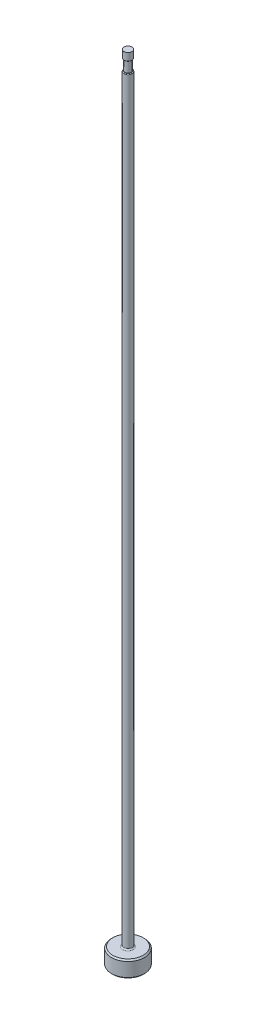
ISO-10303-21;
HEADER;
FILE_DESCRIPTION(('STEP AP214'),'2;1');
FILE_NAME('part.step','',(''),(''),'','','');
FILE_SCHEMA(('AUTOMOTIVE_DESIGN { 1 0 10303 214 1 1 1 1 }'));
ENDSEC;
DATA;
#1=APPLICATION_CONTEXT('core data for automotive mechanical design processes');
#2=APPLICATION_PROTOCOL_DEFINITION('international standard','automotive_design',2000,#1);
#3=PRODUCT_CONTEXT('',#1,'mechanical');
#4=PRODUCT('Part','Part','',(#3));
#5=PRODUCT_RELATED_PRODUCT_CATEGORY('part','',(#4));
#6=PRODUCT_DEFINITION_FORMATION('','',#4);
#7=PRODUCT_DEFINITION_CONTEXT('part definition',#1,'design');
#8=PRODUCT_DEFINITION('design','',#6,#7);
#9=PRODUCT_DEFINITION_SHAPE('','',#8);
#10=(LENGTH_UNIT() NAMED_UNIT(*) SI_UNIT(.MILLI.,.METRE.));
#11=(NAMED_UNIT(*) PLANE_ANGLE_UNIT() SI_UNIT($,.RADIAN.));
#12=(NAMED_UNIT(*) SI_UNIT($,.STERADIAN.) SOLID_ANGLE_UNIT());
#13=UNCERTAINTY_MEASURE_WITH_UNIT(LENGTH_MEASURE(1.E-05),#10,'distance_accuracy_value','');
#14=(GEOMETRIC_REPRESENTATION_CONTEXT(3) GLOBAL_UNCERTAINTY_ASSIGNED_CONTEXT((#13)) GLOBAL_UNIT_ASSIGNED_CONTEXT((#10,
#11,#12)) REPRESENTATION_CONTEXT('',''));
#15=CARTESIAN_POINT('',(0.,0.,0.));
#16=DIRECTION('',(0.,0.,1.));
#17=DIRECTION('',(1.,0.,0.));
#18=AXIS2_PLACEMENT_3D('',#15,#16,#17);
#19=CARTESIAN_POINT('',(-0.793749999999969,150.876,0.));
#20=DIRECTION('',(0.,1.,0.));
#21=DIRECTION('',(0.,0.,1.));
#22=AXIS2_PLACEMENT_3D('',#19,#20,#21);
#23=PLANE('',#22);
#24=CARTESIAN_POINT('',(0.,150.876,0.));
#25=DIRECTION('',(0.,1.,0.));
#26=DIRECTION('',(0.,0.,1.));
#27=AXIS2_PLACEMENT_3D('',#24,#25,#26);
#28=CIRCLE('',#27,0.641349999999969);
#29=CARTESIAN_POINT('',(0.,150.876,0.641349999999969));
#30=VERTEX_POINT('',#29);
#31=EDGE_CURVE('E11',#30,#30,#28,.F.);
#32=ORIENTED_EDGE('',*,*,#31,.T.);
#33=EDGE_LOOP('',(#32));
#34=FACE_BOUND('',#33,.T.);
#35=CARTESIAN_POINT('',(0.,150.876,0.));
#36=DIRECTION('',(0.,1.,0.));
#37=DIRECTION('',(0.,0.,1.));
#38=AXIS2_PLACEMENT_3D('',#35,#36,#37);
#39=CIRCLE('',#38,0.590549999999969);
#40=CARTESIAN_POINT('',(0.,150.876,0.590549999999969));
#41=VERTEX_POINT('',#40);
#42=EDGE_CURVE('E81',#41,#41,#39,.T.);
#43=ORIENTED_EDGE('',*,*,#42,.T.);
#44=EDGE_LOOP('',(#43));
#45=FACE_BOUND('',#44,.T.);
#46=ADVANCED_FACE('F39',(#34,#45),#23,.F.);
#47=CARTESIAN_POINT('',(0.,259.958771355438,0.));
#48=DIRECTION('',(0.,1.,0.));
#49=DIRECTION('',(0.,0.,1.));
#50=AXIS2_PLACEMENT_3D('',#47,#48,#49);
#51=CYLINDRICAL_SURFACE('',#50,0.793749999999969);
#52=DIRECTION('',(0.,1.,0.));
#53=VECTOR('',#52,1.);
#54=CARTESIAN_POINT('',(-0.590549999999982,259.958771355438,-0.530367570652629));
#55=LINE('',#54,#53);
#56=CARTESIAN_POINT('',(-0.590549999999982,148.717,-0.530367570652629));
#57=VERTEX_POINT('',#56);
#58=CARTESIAN_POINT('',(-0.590549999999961,86.36,-0.530367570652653));
#59=VERTEX_POINT('',#58);
#60=EDGE_CURVE('E76',#57,#59,#55,.F.);
#61=ORIENTED_EDGE('',*,*,#60,.F.);
#62=CARTESIAN_POINT('',(0.,148.717,0.));
#63=DIRECTION('',(0.,-1.,0.));
#64=DIRECTION('',(0.,0.,-1.));
#65=AXIS2_PLACEMENT_3D('',#62,#63,#64);
#66=CIRCLE('',#65,0.793749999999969);
#67=CARTESIAN_POINT('',(-0.590549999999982,148.717,0.530367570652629));
#68=VERTEX_POINT('',#67);
#69=EDGE_CURVE('E54',#57,#68,#66,.T.);
#70=ORIENTED_EDGE('',*,*,#69,.T.);
#71=DIRECTION('',(0.,1.,0.));
#72=VECTOR('',#71,1.);
#73=CARTESIAN_POINT('',(-0.590549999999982,259.958771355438,0.530367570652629));
#74=LINE('',#73,#72);
#75=CARTESIAN_POINT('',(-0.590549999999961,86.36,0.530367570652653));
#76=VERTEX_POINT('',#75);
#77=EDGE_CURVE('E87',#76,#68,#74,.T.);
#78=ORIENTED_EDGE('',*,*,#77,.F.);
#79=CARTESIAN_POINT('',(-0.590549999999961,86.36,-0.530367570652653));
#80=CARTESIAN_POINT('',(-0.59053917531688,86.3041966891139,-0.530314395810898));
#81=CARTESIAN_POINT('',(-0.592020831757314,86.2483728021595,-0.528725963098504));
#82=CARTESIAN_POINT('',(-0.597911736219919,86.1368205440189,-0.522091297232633));
#83=CARTESIAN_POINT('',(-0.60233497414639,86.0810939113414,-0.517028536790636));
#84=CARTESIAN_POINT('',(-0.614284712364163,85.9682022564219,-0.502771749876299));
#85=CARTESIAN_POINT('',(-0.62192823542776,85.9110688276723,-0.493420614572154));
#86=CARTESIAN_POINT('',(-0.640090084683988,85.7984288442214,-0.469629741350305));
#87=CARTESIAN_POINT('',(-0.650601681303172,85.7429188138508,-0.455201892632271));
#88=CARTESIAN_POINT('',(-0.672694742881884,85.6407751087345,-0.421752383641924));
#89=CARTESIAN_POINT('',(-0.684015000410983,85.5938538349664,-0.403447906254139));
#90=CARTESIAN_POINT('',(-0.70779345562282,85.503925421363,-0.360113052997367));
#91=CARTESIAN_POINT('',(-0.720238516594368,85.4608824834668,-0.335155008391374));
#92=CARTESIAN_POINT('',(-0.738199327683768,85.4028429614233,-0.292081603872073));
#93=CARTESIAN_POINT('',(-0.74383162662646,85.3852421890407,-0.277537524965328));
#94=CARTESIAN_POINT('',(-0.754779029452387,85.3519385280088,-0.246220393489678));
#95=CARTESIAN_POINT('',(-0.760093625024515,85.3362386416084,-0.229443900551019));
#96=CARTESIAN_POINT('',(-0.770096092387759,85.3073279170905,-0.193256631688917));
#97=CARTESIAN_POINT('',(-0.774774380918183,85.2941541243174,-0.173812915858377));
#98=CARTESIAN_POINT('',(-0.782879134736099,85.271678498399,-0.132572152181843));
#99=CARTESIAN_POINT('',(-0.786309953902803,85.2623631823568,-0.110783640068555));
#100=CARTESIAN_POINT('',(-0.790553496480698,85.2509260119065,-0.0728220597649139));
#101=CARTESIAN_POINT('',(-0.79185392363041,85.2474525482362,-0.0571082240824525));
#102=CARTESIAN_POINT('',(-0.793506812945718,85.2430442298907,-0.0252785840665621));
#103=CARTESIAN_POINT('',(-0.79385989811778,85.2421077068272,-0.00916305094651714));
#104=CARTESIAN_POINT('',(-0.793579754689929,85.2428527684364,0.0230049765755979));
#105=CARTESIAN_POINT('',(-0.792946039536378,85.2445356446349,0.0390574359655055));
#106=CARTESIAN_POINT('',(-0.790759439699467,85.250380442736,0.0706385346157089));
#107=CARTESIAN_POINT('',(-0.789205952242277,85.2545439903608,0.0861668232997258));
#108=CARTESIAN_POINT('',(-0.784847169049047,85.2663438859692,0.120053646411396));
#109=CARTESIAN_POINT('',(-0.781828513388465,85.2745809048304,0.138174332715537));
#110=CARTESIAN_POINT('',(-0.774926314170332,85.2937453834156,0.172744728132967));
#111=CARTESIAN_POINT('',(-0.771041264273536,85.3046775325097,0.189191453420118));
#112=CARTESIAN_POINT('',(-0.760742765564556,85.3342791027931,0.227766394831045));
#113=CARTESIAN_POINT('',(-0.754005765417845,85.3541551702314,0.248875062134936));
#114=CARTESIAN_POINT('',(-0.740079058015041,85.39684818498,0.287657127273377));
#115=CARTESIAN_POINT('',(-0.732888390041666,85.4196714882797,0.305322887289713));
#116=CARTESIAN_POINT('',(-0.713188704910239,85.4850259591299,0.349810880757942));
#117=CARTESIAN_POINT('',(-0.700707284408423,85.5295752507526,0.373653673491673));
#118=CARTESIAN_POINT('',(-0.677153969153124,85.6219372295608,0.414797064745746));
#119=CARTESIAN_POINT('',(-0.666086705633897,85.6697598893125,0.432076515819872));
#120=CARTESIAN_POINT('',(-0.646811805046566,85.7631939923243,0.460367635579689));
#121=CARTESIAN_POINT('',(-0.638441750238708,85.8086519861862,0.471784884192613));
#122=CARTESIAN_POINT('',(-0.623612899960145,85.9006203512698,0.491217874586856));
#123=CARTESIAN_POINT('',(-0.617155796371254,85.9471316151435,0.499230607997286));
#124=CARTESIAN_POINT('',(-0.606291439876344,86.0407368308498,0.512368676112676));
#125=CARTESIAN_POINT('',(-0.601882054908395,86.087830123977,0.517497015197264));
#126=CARTESIAN_POINT('',(-0.595168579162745,86.1823714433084,0.525204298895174));
#127=CARTESIAN_POINT('',(-0.592864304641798,86.229819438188,0.527783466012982));
#128=CARTESIAN_POINT('',(-0.591267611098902,86.2911029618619,0.529567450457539));
#129=CARTESIAN_POINT('',(-0.590998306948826,86.3048916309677,0.529867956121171));
#130=CARTESIAN_POINT('',(-0.590639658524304,86.332453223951,0.530267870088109));
#131=CARTESIAN_POINT('',(-0.59055004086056,86.3462261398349,0.530367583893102));
#132=CARTESIAN_POINT('',(-0.59054999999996,86.3599999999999,0.530367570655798));
#133=B_SPLINE_CURVE_WITH_KNOTS('',3,(#79,#80,#81,#82,#83,#84,#85,#86,#87,#88,#89,#90,#91,#92,
#93,#94,#95,#96,#97,#98,#99,#100,#101,#102,#103,#104,#105,#106,#107,#108,#109,#110,#111,#112,
#113,#114,#115,#116,#117,#118,#119,#120,#121,#122,#123,#124,#125,#126,#127,#128,#129,#130,#131,
#132),.UNSPECIFIED.,.F.,.F.,(4,2,2,2,2,2,2,2,2,2,2,2,2,2,2,2,2,2,2,2,2,2,2,2,2,2,4),(0.,
0.167401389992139,0.335604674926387,0.510534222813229,0.685056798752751,0.839551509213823,
0.992430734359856,1.06284216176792,1.13336338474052,1.20485071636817,1.27608609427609,
1.32431373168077,1.37250964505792,1.42072932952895,1.46898064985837,1.52904518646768,
1.58921497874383,1.67801053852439,1.76700089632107,1.92226871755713,2.07803266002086,
2.22066560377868,2.36342432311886,2.50603406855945,2.64863136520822,2.69001340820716,
2.73133244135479),.UNSPECIFIED.);
#134=EDGE_CURVE('E84',#59,#76,#133,.T.);
#135=ORIENTED_EDGE('',*,*,#134,.F.);
#136=EDGE_LOOP('',(#61,#70,#78,#135));
#137=FACE_BOUND('',#136,.T.);
#138=CARTESIAN_POINT('',(0.,3.42900000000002,0.));
#139=DIRECTION('',(0.,1.,0.));
#140=DIRECTION('',(0.,0.,1.));
#141=AXIS2_PLACEMENT_3D('',#138,#139,#140);
#142=CIRCLE('',#141,0.793749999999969);
#143=CARTESIAN_POINT('',(0.,3.42900000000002,0.793749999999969));
#144=VERTEX_POINT('',#143);
#145=EDGE_CURVE('E119',#144,#144,#142,.T.);
#146=ORIENTED_EDGE('',*,*,#145,.T.);
#147=EDGE_LOOP('',(#146));
#148=FACE_BOUND('',#147,.T.);
#149=ADVANCED_FACE('F85',(#137,#148),#51,.T.);
#150=CARTESIAN_POINT('',(0.,0.,0.));
#151=DIRECTION('',(0.,-1.,0.));
#152=DIRECTION('',(0.,0.,-1.));
#153=AXIS2_PLACEMENT_3D('',#150,#151,#152);
#154=PLANE('',#153);
#155=CARTESIAN_POINT('',(0.,0.,0.));
#156=DIRECTION('',(0.,-1.,0.));
#157=DIRECTION('',(0.,0.,-1.));
#158=AXIS2_PLACEMENT_3D('',#155,#156,#157);
#159=CIRCLE('',#158,2.92099999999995);
#160=CARTESIAN_POINT('',(0.,0.,-2.92099999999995));
#161=VERTEX_POINT('',#160);
#162=EDGE_CURVE('E116',#161,#161,#159,.T.);
#163=ORIENTED_EDGE('',*,*,#162,.T.);
#164=EDGE_LOOP('',(#163));
#165=FACE_BOUND('',#164,.T.);
#166=ADVANCED_FACE('F195',(#165),#154,.T.);
#167=CARTESIAN_POINT('',(0.,259.958771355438,0.));
#168=DIRECTION('',(0.,1.,0.));
#169=DIRECTION('',(0.,0.,1.));
#170=AXIS2_PLACEMENT_3D('',#167,#168,#169);
#171=CYLINDRICAL_SURFACE('',#170,3.17499999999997);
#172=CARTESIAN_POINT('',(0.,2.92100000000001,0.));
#173=DIRECTION('',(0.,1.,0.));
#174=DIRECTION('',(0.,0.,1.));
#175=AXIS2_PLACEMENT_3D('',#172,#173,#174);
#176=CIRCLE('',#175,3.17499999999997);
#177=CARTESIAN_POINT('',(0.,2.92100000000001,3.17499999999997));
#178=VERTEX_POINT('',#177);
#179=EDGE_CURVE('E113',#178,#178,#176,.F.);
#180=ORIENTED_EDGE('',*,*,#179,.T.);
#181=EDGE_LOOP('',(#180));
#182=FACE_BOUND('',#181,.T.);
#183=CARTESIAN_POINT('',(0.,0.254000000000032,0.));
#184=DIRECTION('',(0.,-1.,0.));
#185=DIRECTION('',(0.,0.,-1.));
#186=AXIS2_PLACEMENT_3D('',#183,#184,#185);
#187=CIRCLE('',#186,3.17499999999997);
#188=CARTESIAN_POINT('',(0.,0.254000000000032,-3.17499999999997));
#189=VERTEX_POINT('',#188);
#190=EDGE_CURVE('E110',#189,#189,#187,.F.);
#191=ORIENTED_EDGE('',*,*,#190,.T.);
#192=EDGE_LOOP('',(#191));
#193=FACE_BOUND('',#192,.T.);
#194=ADVANCED_FACE('F198',(#182,#193),#171,.T.);
#195=CARTESIAN_POINT('',(-3.17499999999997,3.175,0.));
#196=DIRECTION('',(0.,1.,0.));
#197=DIRECTION('',(0.,0.,1.));
#198=AXIS2_PLACEMENT_3D('',#195,#196,#197);
#199=PLANE('',#198);
#200=CARTESIAN_POINT('',(0.,3.175,0.));
#201=DIRECTION('',(0.,1.,0.));
#202=DIRECTION('',(0.,0.,1.));
#203=AXIS2_PLACEMENT_3D('',#200,#201,#202);
#204=CIRCLE('',#203,1.04774999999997);
#205=CARTESIAN_POINT('',(0.,3.175,1.04774999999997));
#206=VERTEX_POINT('',#205);
#207=EDGE_CURVE('E90',#206,#206,#204,.F.);
#208=ORIENTED_EDGE('',*,*,#207,.T.);
#209=EDGE_LOOP('',(#208));
#210=FACE_BOUND('',#209,.T.);
#211=CARTESIAN_POINT('',(0.,3.175,0.));
#212=DIRECTION('',(0.,1.,0.));
#213=DIRECTION('',(0.,0.,1.));
#214=AXIS2_PLACEMENT_3D('',#211,#212,#213);
#215=CIRCLE('',#214,2.92099999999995);
#216=CARTESIAN_POINT('',(0.,3.175,2.92099999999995));
#217=VERTEX_POINT('',#216);
#218=EDGE_CURVE('E107',#217,#217,#215,.T.);
#219=ORIENTED_EDGE('',*,*,#218,.T.);
#220=EDGE_LOOP('',(#219));
#221=FACE_BOUND('',#220,.T.);
#222=ADVANCED_FACE('F193',(#210,#221),#199,.T.);
#223=CARTESIAN_POINT('',(0.,3.17499999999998,0.));
#224=DIRECTION('',(0.,-1.,0.));
#225=DIRECTION('',(0.,0.,-1.));
#226=AXIS2_PLACEMENT_3D('',#223,#224,#225);
#227=CONICAL_SURFACE('',#226,2.92099999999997,0.7853981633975);
#228=ORIENTED_EDGE('',*,*,#179,.F.);
#229=EDGE_LOOP('',(#228));
#230=FACE_BOUND('',#229,.T.);
#231=ORIENTED_EDGE('',*,*,#218,.F.);
#232=EDGE_LOOP('',(#231));
#233=FACE_BOUND('',#232,.T.);
#234=ADVANCED_FACE('F189',(#230,#233),#227,.T.);
#235=CARTESIAN_POINT('',(0.,0.254000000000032,0.));
#236=DIRECTION('',(0.,1.,0.));
#237=DIRECTION('',(0.,0.,1.));
#238=AXIS2_PLACEMENT_3D('',#235,#236,#237);
#239=CONICAL_SURFACE('',#238,3.17499999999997,0.785398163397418);
#240=ORIENTED_EDGE('',*,*,#162,.F.);
#241=EDGE_LOOP('',(#240));
#242=FACE_BOUND('',#241,.T.);
#243=ORIENTED_EDGE('',*,*,#190,.F.);
#244=EDGE_LOOP('',(#243));
#245=FACE_BOUND('',#244,.T.);
#246=ADVANCED_FACE('F185',(#242,#245),#239,.T.);
#247=CARTESIAN_POINT('',(0.,3.42900000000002,0.));
#248=DIRECTION('',(0.,1.,0.));
#249=DIRECTION('',(0.,0.,1.));
#250=AXIS2_PLACEMENT_3D('',#247,#248,#249);
#251=TOROIDAL_SURFACE('',#250,1.04774999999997,0.254);
#252=ORIENTED_EDGE('',*,*,#207,.F.);
#253=EDGE_LOOP('',(#252));
#254=FACE_BOUND('',#253,.T.);
#255=ORIENTED_EDGE('',*,*,#145,.F.);
#256=EDGE_LOOP('',(#255));
#257=FACE_BOUND('',#256,.T.);
#258=ADVANCED_FACE('F150',(#254,#257),#251,.F.);
#259=CARTESIAN_POINT('',(-0.793749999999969,148.844,0.));
#260=DIRECTION('',(0.,-1.,0.));
#261=DIRECTION('',(0.,0.,-1.));
#262=AXIS2_PLACEMENT_3D('',#259,#260,#261);
#263=PLANE('',#262);
#264=DIRECTION('',(0.,0.,1.));
#265=VECTOR('',#264,1.);
#266=CARTESIAN_POINT('',(-0.590549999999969,148.844,0.));
#267=LINE('',#266,#265);
#268=CARTESIAN_POINT('',(-0.590549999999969,148.844,0.));
#269=VERTEX_POINT('',#268);
#270=CARTESIAN_POINT('',(-0.590549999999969,148.844,0.309525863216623));
#271=VERTEX_POINT('',#270);
#272=EDGE_CURVE('E93',#269,#271,#267,.T.);
#273=ORIENTED_EDGE('',*,*,#272,.T.);
#274=CARTESIAN_POINT('',(0.,148.844,0.));
#275=DIRECTION('',(0.,-1.,0.));
#276=DIRECTION('',(0.,0.,-1.));
#277=AXIS2_PLACEMENT_3D('',#274,#275,#276);
#278=CIRCLE('',#277,0.666749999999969);
#279=CARTESIAN_POINT('',(-0.590549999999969,148.844,-0.309525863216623));
#280=VERTEX_POINT('',#279);
#281=EDGE_CURVE('E89',#271,#280,#278,.F.);
#282=ORIENTED_EDGE('',*,*,#281,.T.);
#283=EDGE_CURVE('E82',#280,#269,#267,.T.);
#284=ORIENTED_EDGE('',*,*,#283,.T.);
#285=CARTESIAN_POINT('',(0.,148.844,0.));
#286=DIRECTION('',(0.,1.,0.));
#287=DIRECTION('',(0.,0.,1.));
#288=AXIS2_PLACEMENT_3D('',#285,#286,#287);
#289=CIRCLE('',#288,0.590549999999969);
#290=EDGE_CURVE('E104',#269,#269,#289,.T.);
#291=ORIENTED_EDGE('',*,*,#290,.F.);
#292=EDGE_LOOP('',(#273,#282,#284,#291));
#293=FACE_BOUND('',#292,.T.);
#294=ADVANCED_FACE('F147',(#293),#263,.F.);
#295=CARTESIAN_POINT('',(0.,153.448281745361,0.));
#296=DIRECTION('',(0.,1.,0.));
#297=DIRECTION('',(0.,0.,1.));
#298=AXIS2_PLACEMENT_3D('',#295,#296,#297);
#299=CYLINDRICAL_SURFACE('',#298,0.590549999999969);
#300=ORIENTED_EDGE('',*,*,#42,.F.);
#301=EDGE_LOOP('',(#300));
#302=FACE_BOUND('',#301,.T.);
#303=ORIENTED_EDGE('',*,*,#290,.T.);
#304=EDGE_LOOP('',(#303));
#305=FACE_BOUND('',#304,.T.);
#306=ADVANCED_FACE('F144',(#302,#305),#299,.T.);
#307=CARTESIAN_POINT('',(-0.590549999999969,149.86,-3.17499999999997));
#308=DIRECTION('',(1.,0.,0.));
#309=DIRECTION('',(0.,1.,0.));
#310=AXIS2_PLACEMENT_3D('',#307,#308,#309);
#311=PLANE('',#310);
#312=ORIENTED_EDGE('',*,*,#283,.F.);
#313=CARTESIAN_POINT('',(-0.590549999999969,148.844,-0.309525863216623));
#314=CARTESIAN_POINT('',(-0.590549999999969,148.843996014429,-0.320154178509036));
#315=CARTESIAN_POINT('',(-0.590549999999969,148.843711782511,-0.330794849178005));
#316=CARTESIAN_POINT('',(-0.590549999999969,148.842412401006,-0.352104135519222));
#317=CARTESIAN_POINT('',(-0.590549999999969,148.841392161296,-0.362772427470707));
#318=CARTESIAN_POINT('',(-0.590549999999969,148.838423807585,-0.384147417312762));
#319=CARTESIAN_POINT('',(-0.590549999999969,148.836462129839,-0.394852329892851));
#320=CARTESIAN_POINT('',(-0.590549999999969,148.831396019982,-0.415965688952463));
#321=CARTESIAN_POINT('',(-0.590549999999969,148.82829522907,-0.426374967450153));
#322=CARTESIAN_POINT('',(-0.590549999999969,148.821886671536,-0.44351224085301));
#323=CARTESIAN_POINT('',(-0.590549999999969,148.818944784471,-0.450376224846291));
#324=CARTESIAN_POINT('',(-0.590549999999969,148.812316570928,-0.463725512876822));
#325=CARTESIAN_POINT('',(-0.590549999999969,148.808631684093,-0.470211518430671));
#326=CARTESIAN_POINT('',(-0.590549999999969,148.800387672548,-0.482700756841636));
#327=CARTESIAN_POINT('',(-0.590549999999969,148.795820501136,-0.488698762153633));
#328=CARTESIAN_POINT('',(-0.590549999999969,148.785766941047,-0.499879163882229));
#329=CARTESIAN_POINT('',(-0.590549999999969,148.780281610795,-0.505062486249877));
#330=CARTESIAN_POINT('',(-0.590549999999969,148.770008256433,-0.513019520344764));
#331=CARTESIAN_POINT('',(-0.590549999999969,148.765432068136,-0.5160659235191));
#332=CARTESIAN_POINT('',(-0.590549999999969,148.755852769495,-0.521376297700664));
#333=CARTESIAN_POINT('',(-0.590549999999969,148.750850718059,-0.523642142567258));
#334=CARTESIAN_POINT('',(-0.590549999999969,148.741098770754,-0.527042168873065));
#335=CARTESIAN_POINT('',(-0.590549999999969,148.736383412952,-0.528274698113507));
#336=CARTESIAN_POINT('',(-0.590549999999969,148.72678232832,-0.529944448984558));
#337=CARTESIAN_POINT('',(-0.590549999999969,148.72189566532,-0.530376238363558));
#338=CARTESIAN_POINT('',(-0.590549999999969,148.717,-0.530367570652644));
#339=B_SPLINE_CURVE_WITH_KNOTS('',3,(#313,#314,#315,#316,#317,#318,#319,#320,#321,#322,#323,
#324,#325,#326,#327,#328,#329,#330,#331,#332,#333,#334,#335,#336,#337,#338),.UNSPECIFIED.,.F.,
.F.,(4,2,2,2,2,2,2,2,2,2,2,2,4),(0.,0.0319002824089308,0.0640233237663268,0.0966237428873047,
0.129120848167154,0.151487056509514,0.173810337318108,0.196347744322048,0.218859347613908,
0.235290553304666,0.251682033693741,0.266237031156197,0.280890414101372),.UNSPECIFIED.);
#340=EDGE_CURVE('E62',#280,#57,#339,.T.);
#341=ORIENTED_EDGE('',*,*,#340,.T.);
#342=ORIENTED_EDGE('',*,*,#60,.T.);
#343=DIRECTION('',(0.,0.,1.));
#344=VECTOR('',#343,1.);
#345=CARTESIAN_POINT('',(-0.590549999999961,86.36,-3.17499999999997));
#346=LINE('',#345,#344);
#347=EDGE_CURVE('E80',#59,#76,#346,.T.);
#348=ORIENTED_EDGE('',*,*,#347,.T.);
#349=ORIENTED_EDGE('',*,*,#77,.T.);
#350=CARTESIAN_POINT('',(-0.590549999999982,148.717,0.530367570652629));
#351=CARTESIAN_POINT('',(-0.590549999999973,148.722430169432,0.53038055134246));
#352=CARTESIAN_POINT('',(-0.59054999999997,148.727846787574,0.529847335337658));
#353=CARTESIAN_POINT('',(-0.590549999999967,148.738444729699,0.527800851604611));
#354=CARTESIAN_POINT('',(-0.590549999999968,148.743627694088,0.526296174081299));
#355=CARTESIAN_POINT('',(-0.590549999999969,148.753636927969,0.522420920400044));
#356=CARTESIAN_POINT('',(-0.590549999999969,148.758464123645,0.520052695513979));
#357=CARTESIAN_POINT('',(-0.590549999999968,148.767699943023,0.514595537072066));
#358=CARTESIAN_POINT('',(-0.590549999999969,148.772107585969,0.511504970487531));
#359=CARTESIAN_POINT('',(-0.590549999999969,148.782154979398,0.503374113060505));
#360=CARTESIAN_POINT('',(-0.590549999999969,148.787566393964,0.498052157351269));
#361=CARTESIAN_POINT('',(-0.590549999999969,148.79746695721,0.486619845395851));
#362=CARTESIAN_POINT('',(-0.590549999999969,148.801954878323,0.480508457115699));
#363=CARTESIAN_POINT('',(-0.590549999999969,148.812155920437,0.464496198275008));
#364=CARTESIAN_POINT('',(-0.590549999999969,148.817326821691,0.454252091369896));
#365=CARTESIAN_POINT('',(-0.590549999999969,148.82606747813,0.433065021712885));
#366=CARTESIAN_POINT('',(-0.590549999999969,148.829627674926,0.422118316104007));
#367=CARTESIAN_POINT('',(-0.590549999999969,148.836882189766,0.394326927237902));
#368=CARTESIAN_POINT('',(-0.590549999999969,148.839749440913,0.377275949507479));
#369=CARTESIAN_POINT('',(-0.590549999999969,148.843271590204,0.343282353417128));
#370=CARTESIAN_POINT('',(-0.590549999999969,148.843970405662,0.326344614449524));
#371=CARTESIAN_POINT('',(-0.590549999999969,148.844,0.309525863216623));
#372=B_SPLINE_CURVE_WITH_KNOTS('',3,(#350,#351,#352,#353,#354,#355,#356,#357,#358,#359,#360,
#361,#362,#363,#364,#365,#366,#367,#368,#369,#370,#371),.UNSPECIFIED.,.F.,.F.,(4,2,2,2,2,2,2,2,
2,2,4),(0.,0.0162429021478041,0.0323441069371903,0.0484017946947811,0.064496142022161,
0.0871387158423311,0.109811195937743,0.144045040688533,0.178479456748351,0.230172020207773,
0.280810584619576),.UNSPECIFIED.);
#373=EDGE_CURVE('E175',#68,#271,#372,.T.);
#374=ORIENTED_EDGE('',*,*,#373,.T.);
#375=ORIENTED_EDGE('',*,*,#272,.F.);
#376=EDGE_LOOP('',(#312,#341,#342,#348,#349,#374,#375));
#377=FACE_BOUND('',#376,.T.);
#378=ADVANCED_FACE('F78',(#377),#311,.F.);
#379=CARTESIAN_POINT('',(-3.76554999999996,86.36,-3.17499999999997));
#380=DIRECTION('',(0.,0.,1.));
#381=DIRECTION('',(1.,0.,0.));
#382=AXIS2_PLACEMENT_3D('',#379,#380,#381);
#383=CYLINDRICAL_SURFACE('',#382,3.175);
#384=ORIENTED_EDGE('',*,*,#347,.F.);
#385=ORIENTED_EDGE('',*,*,#134,.T.);
#386=EDGE_LOOP('',(#384,#385));
#387=FACE_BOUND('',#386,.T.);
#388=ADVANCED_FACE('F92',(#387),#383,.F.);
#389=CARTESIAN_POINT('',(0.,152.687735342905,0.));
#390=DIRECTION('',(0.,1.,0.));
#391=DIRECTION('',(0.,0.,1.));
#392=AXIS2_PLACEMENT_3D('',#389,#390,#391);
#393=CYLINDRICAL_SURFACE('',#392,0.768349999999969);
#394=CARTESIAN_POINT('',(0.,151.003,0.));
#395=DIRECTION('',(0.,1.,0.));
#396=DIRECTION('',(0.,0.,1.));
#397=AXIS2_PLACEMENT_3D('',#394,#395,#396);
#398=CIRCLE('',#397,0.768349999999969);
#399=CARTESIAN_POINT('',(0.,151.003,0.768349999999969));
#400=VERTEX_POINT('',#399);
#401=EDGE_CURVE('E47',#400,#400,#398,.T.);
#402=ORIENTED_EDGE('',*,*,#401,.T.);
#403=EDGE_LOOP('',(#402));
#404=FACE_BOUND('',#403,.T.);
#405=CARTESIAN_POINT('',(0.,152.4,0.));
#406=DIRECTION('',(0.,1.,0.));
#407=DIRECTION('',(0.,0.,1.));
#408=AXIS2_PLACEMENT_3D('',#405,#406,#407);
#409=CIRCLE('',#408,0.768349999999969);
#410=CARTESIAN_POINT('',(0.,152.4,0.768349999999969));
#411=VERTEX_POINT('',#410);
#412=EDGE_CURVE('E94',#411,#411,#409,.T.);
#413=ORIENTED_EDGE('',*,*,#412,.F.);
#414=EDGE_LOOP('',(#413));
#415=FACE_BOUND('',#414,.T.);
#416=ADVANCED_FACE('F138',(#404,#415),#393,.T.);
#417=CARTESIAN_POINT('',(-0.793749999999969,152.4,0.));
#418=DIRECTION('',(0.,1.,0.));
#419=DIRECTION('',(0.,0.,1.));
#420=AXIS2_PLACEMENT_3D('',#417,#418,#419);
#421=PLANE('',#420);
#422=ORIENTED_EDGE('',*,*,#412,.T.);
#423=EDGE_LOOP('',(#422));
#424=FACE_BOUND('',#423,.T.);
#425=ADVANCED_FACE('F152',(#424),#421,.T.);
#426=CARTESIAN_POINT('',(0.,148.717,0.));
#427=DIRECTION('',(0.,-1.,0.));
#428=DIRECTION('',(0.,0.,-1.));
#429=AXIS2_PLACEMENT_3D('',#426,#427,#428);
#430=TOROIDAL_SURFACE('',#429,0.666749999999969,0.127);
#431=ORIENTED_EDGE('',*,*,#373,.F.);
#432=ORIENTED_EDGE('',*,*,#69,.F.);
#433=ORIENTED_EDGE('',*,*,#340,.F.);
#434=ORIENTED_EDGE('',*,*,#281,.F.);
#435=EDGE_LOOP('',(#431,#432,#433,#434));
#436=FACE_BOUND('',#435,.T.);
#437=ADVANCED_FACE('F154',(#436),#430,.T.);
#438=CARTESIAN_POINT('',(0.,151.003,0.));
#439=DIRECTION('',(0.,1.,0.));
#440=DIRECTION('',(0.,0.,1.));
#441=AXIS2_PLACEMENT_3D('',#438,#439,#440);
#442=TOROIDAL_SURFACE('',#441,0.641349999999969,0.127);
#443=ORIENTED_EDGE('',*,*,#31,.F.);
#444=EDGE_LOOP('',(#443));
#445=FACE_BOUND('',#444,.T.);
#446=ORIENTED_EDGE('',*,*,#401,.F.);
#447=EDGE_LOOP('',(#446));
#448=FACE_BOUND('',#447,.T.);
#449=ADVANCED_FACE('F41',(#445,#448),#442,.T.);
#450=CLOSED_SHELL('',(#46,#149,#166,#194,#222,#234,#246,#258,#294,#306,#378,#388,#416,#425,#437,#449));
#451=MANIFOLD_SOLID_BREP('B2',#450);
#452=ADVANCED_BREP_SHAPE_REPRESENTATION('',(#18,#451),#14);
#453=SHAPE_DEFINITION_REPRESENTATION(#9,#452);
ENDSEC;
END-ISO-10303-21;
